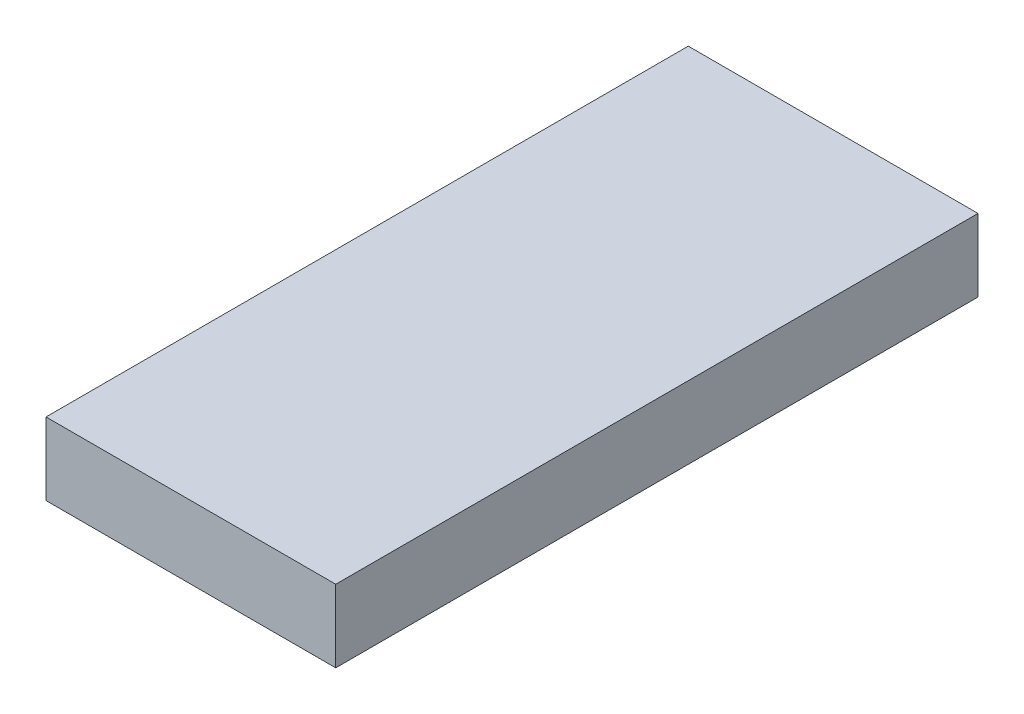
ISO-10303-21;
HEADER;
FILE_DESCRIPTION(('STEP AP214'),'2;1');
FILE_NAME('part.step','',(''),(''),'','','');
FILE_SCHEMA(('AUTOMOTIVE_DESIGN { 1 0 10303 214 1 1 1 1 }'));
ENDSEC;
DATA;
#1=APPLICATION_CONTEXT('core data for automotive mechanical design processes');
#2=APPLICATION_PROTOCOL_DEFINITION('international standard','automotive_design',2000,#1);
#3=PRODUCT_CONTEXT('',#1,'mechanical');
#4=PRODUCT('Part','Part','',(#3));
#5=PRODUCT_RELATED_PRODUCT_CATEGORY('part','',(#4));
#6=PRODUCT_DEFINITION_FORMATION('','',#4);
#7=PRODUCT_DEFINITION_CONTEXT('part definition',#1,'design');
#8=PRODUCT_DEFINITION('design','',#6,#7);
#9=PRODUCT_DEFINITION_SHAPE('','',#8);
#10=(LENGTH_UNIT() NAMED_UNIT(*) SI_UNIT(.MILLI.,.METRE.));
#11=(NAMED_UNIT(*) PLANE_ANGLE_UNIT() SI_UNIT($,.RADIAN.));
#12=(NAMED_UNIT(*) SI_UNIT($,.STERADIAN.) SOLID_ANGLE_UNIT());
#13=UNCERTAINTY_MEASURE_WITH_UNIT(LENGTH_MEASURE(1.E-05),#10,'distance_accuracy_value','');
#14=(GEOMETRIC_REPRESENTATION_CONTEXT(3) GLOBAL_UNCERTAINTY_ASSIGNED_CONTEXT((#13)) GLOBAL_UNIT_ASSIGNED_CONTEXT((#10,
#11,#12)) REPRESENTATION_CONTEXT('',''));
#15=CARTESIAN_POINT('',(0.,0.,0.));
#16=DIRECTION('',(0.,0.,1.));
#17=DIRECTION('',(1.,0.,0.));
#18=AXIS2_PLACEMENT_3D('',#15,#16,#17);
#19=CARTESIAN_POINT('',(0.,0.,133.));
#20=DIRECTION('',(1.,0.,0.));
#21=DIRECTION('',(0.,0.,-1.));
#22=AXIS2_PLACEMENT_3D('',#19,#20,#21);
#23=PLANE('',#22);
#24=DIRECTION('',(0.,-1.,0.));
#25=VECTOR('',#24,1.);
#26=CARTESIAN_POINT('',(0.,0.,0.));
#27=LINE('',#26,#25);
#28=CARTESIAN_POINT('',(0.,15.,0.));
#29=VERTEX_POINT('',#28);
#30=CARTESIAN_POINT('',(0.,0.,0.));
#31=VERTEX_POINT('',#30);
#32=EDGE_CURVE('E95',#29,#31,#27,.T.);
#33=ORIENTED_EDGE('',*,*,#32,.T.);
#34=DIRECTION('',(0.,0.,-1.));
#35=VECTOR('',#34,1.);
#36=CARTESIAN_POINT('',(0.,0.,133.));
#37=LINE('',#36,#35);
#38=CARTESIAN_POINT('',(0.,0.,133.));
#39=VERTEX_POINT('',#38);
#40=EDGE_CURVE('E11',#39,#31,#37,.T.);
#41=ORIENTED_EDGE('',*,*,#40,.F.);
#42=DIRECTION('',(0.,-1.,0.));
#43=VECTOR('',#42,1.);
#44=CARTESIAN_POINT('',(0.,0.,133.));
#45=LINE('',#44,#43);
#46=CARTESIAN_POINT('',(0.,15.,133.));
#47=VERTEX_POINT('',#46);
#48=EDGE_CURVE('E83',#47,#39,#45,.T.);
#49=ORIENTED_EDGE('',*,*,#48,.F.);
#50=DIRECTION('',(0.,0.,-1.));
#51=VECTOR('',#50,1.);
#52=CARTESIAN_POINT('',(0.,15.,133.));
#53=LINE('',#52,#51);
#54=EDGE_CURVE('E91',#47,#29,#53,.T.);
#55=ORIENTED_EDGE('',*,*,#54,.T.);
#56=EDGE_LOOP('',(#33,#41,#49,#55));
#57=FACE_BOUND('',#56,.T.);
#58=ADVANCED_FACE('F32',(#57),#23,.F.);
#59=CARTESIAN_POINT('',(0.,0.,133.));
#60=DIRECTION('',(0.,1.,0.));
#61=DIRECTION('',(0.,0.,1.));
#62=AXIS2_PLACEMENT_3D('',#59,#60,#61);
#63=PLANE('',#62);
#64=DIRECTION('',(1.,0.,0.));
#65=VECTOR('',#64,1.);
#66=CARTESIAN_POINT('',(0.,0.,0.));
#67=LINE('',#66,#65);
#68=CARTESIAN_POINT('',(60.,0.,0.));
#69=VERTEX_POINT('',#68);
#70=EDGE_CURVE('E87',#31,#69,#67,.T.);
#71=ORIENTED_EDGE('',*,*,#70,.T.);
#72=DIRECTION('',(0.,0.,-1.));
#73=VECTOR('',#72,1.);
#74=CARTESIAN_POINT('',(60.,0.,133.));
#75=LINE('',#74,#73);
#76=CARTESIAN_POINT('',(60.,0.,133.));
#77=VERTEX_POINT('',#76);
#78=EDGE_CURVE('E40',#77,#69,#75,.T.);
#79=ORIENTED_EDGE('',*,*,#78,.F.);
#80=DIRECTION('',(1.,0.,0.));
#81=VECTOR('',#80,1.);
#82=CARTESIAN_POINT('',(0.,0.,133.));
#83=LINE('',#82,#81);
#84=EDGE_CURVE('E78',#39,#77,#83,.T.);
#85=ORIENTED_EDGE('',*,*,#84,.F.);
#86=ORIENTED_EDGE('',*,*,#40,.T.);
#87=EDGE_LOOP('',(#71,#79,#85,#86));
#88=FACE_BOUND('',#87,.T.);
#89=ADVANCED_FACE('F86',(#88),#63,.F.);
#90=CARTESIAN_POINT('',(60.,0.,133.));
#91=DIRECTION('',(-1.,0.,0.));
#92=DIRECTION('',(0.,0.,1.));
#93=AXIS2_PLACEMENT_3D('',#90,#91,#92);
#94=PLANE('',#93);
#95=DIRECTION('',(0.,1.,0.));
#96=VECTOR('',#95,1.);
#97=CARTESIAN_POINT('',(60.,0.,0.));
#98=LINE('',#97,#96);
#99=CARTESIAN_POINT('',(60.,15.,0.));
#100=VERTEX_POINT('',#99);
#101=EDGE_CURVE('E65',#69,#100,#98,.T.);
#102=ORIENTED_EDGE('',*,*,#101,.T.);
#103=DIRECTION('',(0.,0.,-1.));
#104=VECTOR('',#103,1.);
#105=CARTESIAN_POINT('',(60.,15.,133.));
#106=LINE('',#105,#104);
#107=CARTESIAN_POINT('',(60.,15.,133.));
#108=VERTEX_POINT('',#107);
#109=EDGE_CURVE('E88',#108,#100,#106,.T.);
#110=ORIENTED_EDGE('',*,*,#109,.F.);
#111=DIRECTION('',(0.,1.,0.));
#112=VECTOR('',#111,1.);
#113=CARTESIAN_POINT('',(60.,0.,133.));
#114=LINE('',#113,#112);
#115=EDGE_CURVE('E81',#77,#108,#114,.T.);
#116=ORIENTED_EDGE('',*,*,#115,.F.);
#117=ORIENTED_EDGE('',*,*,#78,.T.);
#118=EDGE_LOOP('',(#102,#110,#116,#117));
#119=FACE_BOUND('',#118,.T.);
#120=ADVANCED_FACE('F89',(#119),#94,.F.);
#121=CARTESIAN_POINT('',(0.,15.,133.));
#122=DIRECTION('',(0.,-1.,0.));
#123=DIRECTION('',(0.,0.,-1.));
#124=AXIS2_PLACEMENT_3D('',#121,#122,#123);
#125=PLANE('',#124);
#126=DIRECTION('',(-1.,0.,0.));
#127=VECTOR('',#126,1.);
#128=CARTESIAN_POINT('',(0.,15.,0.));
#129=LINE('',#128,#127);
#130=EDGE_CURVE('E71',#100,#29,#129,.T.);
#131=ORIENTED_EDGE('',*,*,#130,.T.);
#132=ORIENTED_EDGE('',*,*,#54,.F.);
#133=DIRECTION('',(-1.,0.,0.));
#134=VECTOR('',#133,1.);
#135=CARTESIAN_POINT('',(0.,15.,133.));
#136=LINE('',#135,#134);
#137=EDGE_CURVE('E48',#108,#47,#136,.T.);
#138=ORIENTED_EDGE('',*,*,#137,.F.);
#139=ORIENTED_EDGE('',*,*,#109,.T.);
#140=EDGE_LOOP('',(#131,#132,#138,#139));
#141=FACE_BOUND('',#140,.T.);
#142=ADVANCED_FACE('F102',(#141),#125,.F.);
#143=CARTESIAN_POINT('',(0.,15.,133.));
#144=DIRECTION('',(0.,0.,-1.));
#145=DIRECTION('',(-1.,0.,0.));
#146=AXIS2_PLACEMENT_3D('',#143,#144,#145);
#147=PLANE('',#146);
#148=ORIENTED_EDGE('',*,*,#48,.T.);
#149=ORIENTED_EDGE('',*,*,#84,.T.);
#150=ORIENTED_EDGE('',*,*,#115,.T.);
#151=ORIENTED_EDGE('',*,*,#137,.T.);
#152=EDGE_LOOP('',(#148,#149,#150,#151));
#153=FACE_BOUND('',#152,.T.);
#154=ADVANCED_FACE('F79',(#153),#147,.F.);
#155=CARTESIAN_POINT('',(0.,15.,0.));
#156=DIRECTION('',(0.,0.,-1.));
#157=DIRECTION('',(-1.,0.,0.));
#158=AXIS2_PLACEMENT_3D('',#155,#156,#157);
#159=PLANE('',#158);
#160=ORIENTED_EDGE('',*,*,#32,.F.);
#161=ORIENTED_EDGE('',*,*,#130,.F.);
#162=ORIENTED_EDGE('',*,*,#101,.F.);
#163=ORIENTED_EDGE('',*,*,#70,.F.);
#164=EDGE_LOOP('',(#160,#161,#162,#163));
#165=FACE_BOUND('',#164,.T.);
#166=ADVANCED_FACE('F105',(#165),#159,.T.);
#167=CLOSED_SHELL('',(#58,#89,#120,#142,#154,#166));
#168=MANIFOLD_SOLID_BREP('B2',#167);
#169=ADVANCED_BREP_SHAPE_REPRESENTATION('',(#18,#168),#14);
#170=SHAPE_DEFINITION_REPRESENTATION(#9,#169);
ENDSEC;
END-ISO-10303-21;
